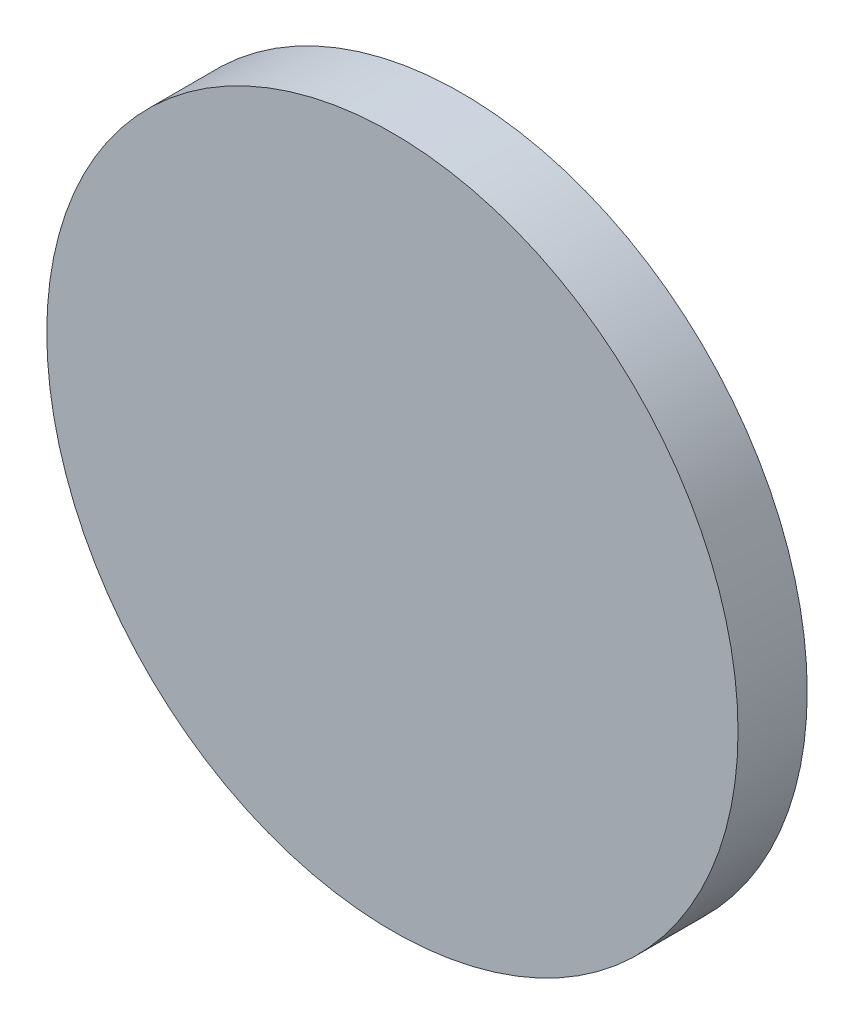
from build123d import *

# Parameters (mm, degrees)
SKIZZE1_R                       = 49.948648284
AUFSATZ_LINEAR_AUSTRAGEN1_DEPTH = 10


with BuildPart() as part:
    # Skizze1 → Aufsatz-Linear austragen1 (new body)
    with BuildSketch(Plane.XY):
        with Locations((-13.876426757, 74.759707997)):
            Circle(SKIZZE1_R)
    extrude(amount=AUFSATZ_LINEAR_AUSTRAGEN1_DEPTH)


solid = part.part
